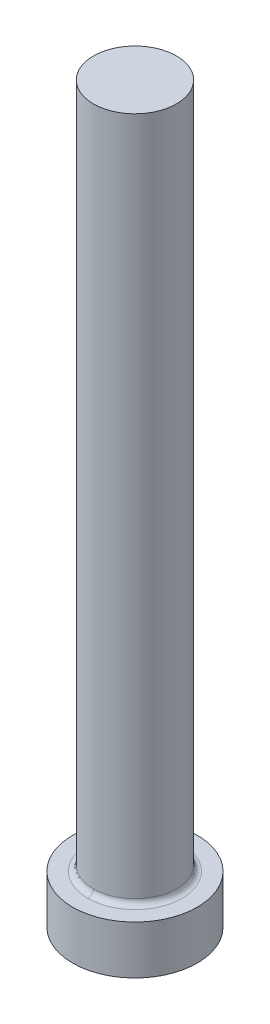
ISO-10303-21;
HEADER;
FILE_DESCRIPTION(('STEP AP214'),'2;1');
FILE_NAME('part.step','',(''),(''),'','','');
FILE_SCHEMA(('AUTOMOTIVE_DESIGN { 1 0 10303 214 1 1 1 1 }'));
ENDSEC;
DATA;
#1=APPLICATION_CONTEXT('core data for automotive mechanical design processes');
#2=APPLICATION_PROTOCOL_DEFINITION('international standard','automotive_design',2000,#1);
#3=PRODUCT_CONTEXT('',#1,'mechanical');
#4=PRODUCT('Part','Part','',(#3));
#5=PRODUCT_RELATED_PRODUCT_CATEGORY('part','',(#4));
#6=PRODUCT_DEFINITION_FORMATION('','',#4);
#7=PRODUCT_DEFINITION_CONTEXT('part definition',#1,'design');
#8=PRODUCT_DEFINITION('design','',#6,#7);
#9=PRODUCT_DEFINITION_SHAPE('','',#8);
#10=(LENGTH_UNIT() NAMED_UNIT(*) SI_UNIT(.MILLI.,.METRE.));
#11=(NAMED_UNIT(*) PLANE_ANGLE_UNIT() SI_UNIT($,.RADIAN.));
#12=(NAMED_UNIT(*) SI_UNIT($,.STERADIAN.) SOLID_ANGLE_UNIT());
#13=UNCERTAINTY_MEASURE_WITH_UNIT(LENGTH_MEASURE(1.E-05),#10,'distance_accuracy_value','');
#14=(GEOMETRIC_REPRESENTATION_CONTEXT(3) GLOBAL_UNCERTAINTY_ASSIGNED_CONTEXT((#13)) GLOBAL_UNIT_ASSIGNED_CONTEXT((#10,
#11,#12)) REPRESENTATION_CONTEXT('',''));
#15=CARTESIAN_POINT('',(0.,0.,0.));
#16=DIRECTION('',(0.,0.,1.));
#17=DIRECTION('',(1.,0.,0.));
#18=AXIS2_PLACEMENT_3D('',#15,#16,#17);
#19=CARTESIAN_POINT('',(55.892,-106.,-86.108));
#20=DIRECTION('',(0.,-1.,0.));
#21=DIRECTION('',(1.,0.,0.));
#22=AXIS2_PLACEMENT_3D('',#19,#20,#21);
#23=PLANE('',#22);
#24=CARTESIAN_POINT('',(65.,-106.,-77.));
#25=DIRECTION('',(0.,1.,0.));
#26=DIRECTION('',(0.,0.,1.));
#27=AXIS2_PLACEMENT_3D('',#24,#25,#26);
#28=CIRCLE('',#27,9.);
#29=CARTESIAN_POINT('',(65.,-106.,-68.));
#30=VERTEX_POINT('',#29);
#31=EDGE_CURVE('E29',#30,#30,#28,.F.);
#32=ORIENTED_EDGE('',*,*,#31,.T.);
#33=EDGE_LOOP('',(#32));
#34=FACE_BOUND('',#33,.T.);
#35=ADVANCED_FACE('F24',(#34),#23,.T.);
#36=CARTESIAN_POINT('',(65.,-106.,-77.));
#37=DIRECTION('',(0.,1.,0.));
#38=DIRECTION('',(0.,0.,1.));
#39=AXIS2_PLACEMENT_3D('',#36,#37,#38);
#40=CYLINDRICAL_SURFACE('',#39,9.);
#41=ORIENTED_EDGE('',*,*,#31,.F.);
#42=EDGE_LOOP('',(#41));
#43=FACE_BOUND('',#42,.T.);
#44=CARTESIAN_POINT('',(65.,-99.,-77.));
#45=DIRECTION('',(0.,1.,0.));
#46=DIRECTION('',(0.,0.,1.));
#47=AXIS2_PLACEMENT_3D('',#44,#45,#46);
#48=CIRCLE('',#47,9.);
#49=CARTESIAN_POINT('',(65.,-99.,-68.));
#50=VERTEX_POINT('',#49);
#51=EDGE_CURVE('E65',#50,#50,#48,.T.);
#52=ORIENTED_EDGE('',*,*,#51,.F.);
#53=EDGE_LOOP('',(#52));
#54=FACE_BOUND('',#53,.T.);
#55=ADVANCED_FACE('F100',(#43,#54),#40,.T.);
#56=CARTESIAN_POINT('',(71.072,0.,-70.928));
#57=DIRECTION('',(0.,-1.,0.));
#58=DIRECTION('',(-1.,0.,0.));
#59=AXIS2_PLACEMENT_3D('',#56,#57,#58);
#60=PLANE('',#59);
#61=CARTESIAN_POINT('',(65.,0.,-77.));
#62=DIRECTION('',(0.,1.,0.));
#63=DIRECTION('',(0.,0.,1.));
#64=AXIS2_PLACEMENT_3D('',#61,#62,#63);
#65=CIRCLE('',#64,6.);
#66=CARTESIAN_POINT('',(65.,0.,-71.));
#67=VERTEX_POINT('',#66);
#68=EDGE_CURVE('E64',#67,#67,#65,.T.);
#69=ORIENTED_EDGE('',*,*,#68,.T.);
#70=EDGE_LOOP('',(#69));
#71=FACE_BOUND('',#70,.T.);
#72=ADVANCED_FACE('F99',(#71),#60,.F.);
#73=CARTESIAN_POINT('',(65.,-98.996003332,-70.120133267));
#74=CARTESIAN_POINT('',(78.759733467,-98.996003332,-70.120133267));
#75=CARTESIAN_POINT('',(78.759733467,-98.996003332,-83.879866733));
#76=CARTESIAN_POINT('',(65.,-98.996003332,-83.879866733));
#77=CARTESIAN_POINT('',(65.,-99.050576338,-70.664043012));
#78=CARTESIAN_POINT('',(77.671913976,-99.050576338,-70.664043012));
#79=CARTESIAN_POINT('',(77.671913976,-99.050576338,-83.335956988));
#80=CARTESIAN_POINT('',(65.,-99.050576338,-83.335956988));
#81=CARTESIAN_POINT('',(65.,-98.664043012,-71.050576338));
#82=CARTESIAN_POINT('',(76.898847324,-98.664043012,-71.050576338));
#83=CARTESIAN_POINT('',(76.898847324,-98.664043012,-82.949423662));
#84=CARTESIAN_POINT('',(65.,-98.664043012,-82.949423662));
#85=CARTESIAN_POINT('',(65.,-98.120133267,-70.996003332));
#86=CARTESIAN_POINT('',(77.007993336,-98.120133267,-70.996003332));
#87=CARTESIAN_POINT('',(77.007993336,-98.120133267,-83.003996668));
#88=CARTESIAN_POINT('',(65.,-98.120133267,-83.003996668));
#89=(BOUNDED_SURFACE() B_SPLINE_SURFACE(3,3,((#73,#74,#75,#76),(#77,#78,#79,#80),(#81,#82,#83,
#84),(#85,#86,#87,#88)),.UNSPECIFIED.,.F.,.F.,.F.) B_SPLINE_SURFACE_WITH_KNOTS((4,4),(4,4),(0.,
1.),(0.,1.),.UNSPECIFIED.) GEOMETRIC_REPRESENTATION_ITEM() RATIONAL_B_SPLINE_SURFACE(((1.,
0.333333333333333,0.333333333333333,1.),(0.755320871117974,0.251773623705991,0.251773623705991,
0.755320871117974),(0.755320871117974,0.251773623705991,0.251773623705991,0.755320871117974),
(1.,0.333333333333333,0.333333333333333,1.))) REPRESENTATION_ITEM('') SURFACE());
#90=CARTESIAN_POINT('',(65.,-98.2,-77.));
#91=DIRECTION('',(0.,1.,0.));
#92=DIRECTION('',(-1.,0.,0.));
#93=AXIS2_PLACEMENT_3D('',#90,#91,#92);
#94=CIRCLE('',#93,6.);
#95=CARTESIAN_POINT('',(65.,-98.2000000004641,-83.0000000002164));
#96=VERTEX_POINT('',#95);
#97=CARTESIAN_POINT('',(65.,-98.2000000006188,-70.9999999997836));
#98=VERTEX_POINT('',#97);
#99=EDGE_CURVE('E50',#96,#98,#94,.F.);
#100=CARTESIAN_POINT('',(65.,-98.996003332,-70.120133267));
#101=CARTESIAN_POINT('',(65.,-99.050576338,-70.664043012));
#102=CARTESIAN_POINT('',(65.,-98.664043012,-71.050576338));
#103=CARTESIAN_POINT('',(65.,-98.120133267,-70.996003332));
#104=(BOUNDED_CURVE() B_SPLINE_CURVE(3,(#100,#101,#102,#103),.UNSPECIFIED.,.F.,
.F.) B_SPLINE_CURVE_WITH_KNOTS((4,4),(0.,1.),
.UNSPECIFIED.) CURVE() GEOMETRIC_REPRESENTATION_ITEM() RATIONAL_B_SPLINE_CURVE((1.,
0.755320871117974,0.755320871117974,1.)) REPRESENTATION_ITEM(''));
#105=CARTESIAN_POINT('',(65.,-98.9999999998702,-70.2000000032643));
#106=VERTEX_POINT('',#105);
#107=EDGE_CURVE('E52',#106,#98,#104,.T.);
#108=CARTESIAN_POINT('',(65.,-98.9999999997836,-70.2000000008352));
#109=CARTESIAN_POINT('',(78.5999999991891,-98.9999999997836,-70.2000000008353));
#110=CARTESIAN_POINT('',(78.5999999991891,-98.9999999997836,-83.7999999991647));
#111=CARTESIAN_POINT('',(65.,-98.9999999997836,-83.7999999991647));
#112=(BOUNDED_CURVE() B_SPLINE_CURVE(3,(#108,#109,#110,#111),.UNSPECIFIED.,.F.,
.F.) B_SPLINE_CURVE_WITH_KNOTS((4,4),(0.,1.),
.UNSPECIFIED.) CURVE() GEOMETRIC_REPRESENTATION_ITEM() RATIONAL_B_SPLINE_CURVE((0.956578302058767,
0.318859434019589,0.318859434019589,0.956578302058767)) REPRESENTATION_ITEM(''));
#113=CARTESIAN_POINT('',(65.,-98.9999999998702,-83.7999999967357));
#114=VERTEX_POINT('',#113);
#115=EDGE_CURVE('E55',#114,#106,#112,.F.);
#116=CARTESIAN_POINT('',(65.,-98.996003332,-83.879866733));
#117=CARTESIAN_POINT('',(65.,-99.050576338,-83.335956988));
#118=CARTESIAN_POINT('',(65.,-98.664043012,-82.949423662));
#119=CARTESIAN_POINT('',(65.,-98.120133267,-83.003996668));
#120=(BOUNDED_CURVE() B_SPLINE_CURVE(3,(#116,#117,#118,#119),.UNSPECIFIED.,.F.,
.F.) B_SPLINE_CURVE_WITH_KNOTS((4,4),(0.,1.),
.UNSPECIFIED.) CURVE() GEOMETRIC_REPRESENTATION_ITEM() RATIONAL_B_SPLINE_CURVE((1.,
0.755320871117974,0.755320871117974,1.)) REPRESENTATION_ITEM(''));
#121=EDGE_CURVE('E58',#96,#114,#120,.F.);
#122=ORIENTED_EDGE('',*,*,#99,.T.);
#123=ORIENTED_EDGE('',*,*,#107,.F.);
#124=ORIENTED_EDGE('',*,*,#115,.F.);
#125=ORIENTED_EDGE('',*,*,#121,.F.);
#126=EDGE_LOOP('',(#122,#123,#124,#125));
#127=FACE_BOUND('',#126,.T.);
#128=ADVANCED_FACE('F54',(#127),#89,.F.);
#129=CARTESIAN_POINT('',(74.108,-99.,-86.108));
#130=DIRECTION('',(0.,1.,0.));
#131=DIRECTION('',(-1.,0.,0.));
#132=AXIS2_PLACEMENT_3D('',#129,#130,#131);
#133=PLANE('',#132);
#134=ORIENTED_EDGE('',*,*,#115,.T.);
#135=CARTESIAN_POINT('',(65.,-98.9999999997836,-83.7999999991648));
#136=CARTESIAN_POINT('',(51.4000000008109,-98.9999999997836,-83.7999999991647));
#137=CARTESIAN_POINT('',(51.4000000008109,-98.9999999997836,-70.2000000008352));
#138=CARTESIAN_POINT('',(65.,-98.9999999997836,-70.2000000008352));
#139=(BOUNDED_CURVE() B_SPLINE_CURVE(3,(#135,#136,#137,#138),.UNSPECIFIED.,.F.,
.F.) B_SPLINE_CURVE_WITH_KNOTS((4,4),(0.,1.),
.UNSPECIFIED.) CURVE() GEOMETRIC_REPRESENTATION_ITEM() RATIONAL_B_SPLINE_CURVE((0.956578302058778,
0.318859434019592,0.318859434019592,0.956578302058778)) REPRESENTATION_ITEM(''));
#140=EDGE_CURVE('E13',#106,#114,#139,.F.);
#141=ORIENTED_EDGE('',*,*,#140,.T.);
#142=EDGE_LOOP('',(#134,#141));
#143=FACE_BOUND('',#142,.T.);
#144=ORIENTED_EDGE('',*,*,#51,.T.);
#145=EDGE_LOOP('',(#144));
#146=FACE_BOUND('',#145,.T.);
#147=ADVANCED_FACE('F26',(#143,#146),#133,.T.);
#148=CARTESIAN_POINT('',(65.,-98.2,-77.));
#149=DIRECTION('',(0.,1.,0.));
#150=DIRECTION('',(0.,0.,1.));
#151=AXIS2_PLACEMENT_3D('',#148,#149,#150);
#152=CYLINDRICAL_SURFACE('',#151,6.);
#153=ORIENTED_EDGE('',*,*,#99,.F.);
#154=CARTESIAN_POINT('',(65.,-98.2000000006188,-77.));
#155=DIRECTION('',(0.,1.,0.));
#156=DIRECTION('',(0.,0.,1.));
#157=AXIS2_PLACEMENT_3D('',#154,#155,#156);
#158=CIRCLE('',#157,6.0000000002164);
#159=EDGE_CURVE('E35',#96,#98,#158,.T.);
#160=ORIENTED_EDGE('',*,*,#159,.T.);
#161=EDGE_LOOP('',(#153,#160));
#162=FACE_BOUND('',#161,.T.);
#163=ORIENTED_EDGE('',*,*,#68,.F.);
#164=EDGE_LOOP('',(#163));
#165=FACE_BOUND('',#164,.T.);
#166=ADVANCED_FACE('F85',(#162,#165),#152,.T.);
#167=CARTESIAN_POINT('',(65.,-98.996003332,-83.879866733));
#168=CARTESIAN_POINT('',(51.240266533,-98.996003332,-83.879866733));
#169=CARTESIAN_POINT('',(51.240266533,-98.996003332,-70.120133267));
#170=CARTESIAN_POINT('',(65.,-98.996003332,-70.120133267));
#171=CARTESIAN_POINT('',(65.,-99.050576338,-83.335956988));
#172=CARTESIAN_POINT('',(52.328086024,-99.050576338,-83.335956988));
#173=CARTESIAN_POINT('',(52.328086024,-99.050576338,-70.664043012));
#174=CARTESIAN_POINT('',(65.,-99.050576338,-70.664043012));
#175=CARTESIAN_POINT('',(65.,-98.664043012,-82.949423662));
#176=CARTESIAN_POINT('',(53.101152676,-98.664043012,-82.949423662));
#177=CARTESIAN_POINT('',(53.101152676,-98.664043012,-71.050576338));
#178=CARTESIAN_POINT('',(65.,-98.664043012,-71.050576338));
#179=CARTESIAN_POINT('',(65.,-98.120133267,-83.003996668));
#180=CARTESIAN_POINT('',(52.992006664,-98.120133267,-83.003996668));
#181=CARTESIAN_POINT('',(52.992006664,-98.120133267,-70.996003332));
#182=CARTESIAN_POINT('',(65.,-98.120133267,-70.996003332));
#183=(BOUNDED_SURFACE() B_SPLINE_SURFACE(3,3,((#167,#168,#169,#170),(#171,#172,#173,#174),(#175,
#176,#177,#178),(#179,#180,#181,#182)),.UNSPECIFIED.,.F.,.F.,
.F.) B_SPLINE_SURFACE_WITH_KNOTS((4,4),(4,4),(0.,1.),(0.,1.),
.UNSPECIFIED.) GEOMETRIC_REPRESENTATION_ITEM() RATIONAL_B_SPLINE_SURFACE(((1.,0.333333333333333,
0.333333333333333,1.),(0.755320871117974,0.251773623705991,0.251773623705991,0.755320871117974),
(0.755320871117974,0.251773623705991,0.251773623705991,0.755320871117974),(1.,0.333333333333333,
0.333333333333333,1.))) REPRESENTATION_ITEM('') SURFACE());
#184=ORIENTED_EDGE('',*,*,#121,.T.);
#185=ORIENTED_EDGE('',*,*,#140,.F.);
#186=ORIENTED_EDGE('',*,*,#107,.T.);
#187=ORIENTED_EDGE('',*,*,#159,.F.);
#188=EDGE_LOOP('',(#184,#185,#186,#187));
#189=FACE_BOUND('',#188,.T.);
#190=ADVANCED_FACE('F69',(#189),#183,.F.);
#191=CLOSED_SHELL('',(#35,#55,#72,#128,#147,#166,#190));
#192=MANIFOLD_SOLID_BREP('B1',#191);
#193=ADVANCED_BREP_SHAPE_REPRESENTATION('',(#18,#192),#14);
#194=SHAPE_DEFINITION_REPRESENTATION(#9,#193);
ENDSEC;
END-ISO-10303-21;
